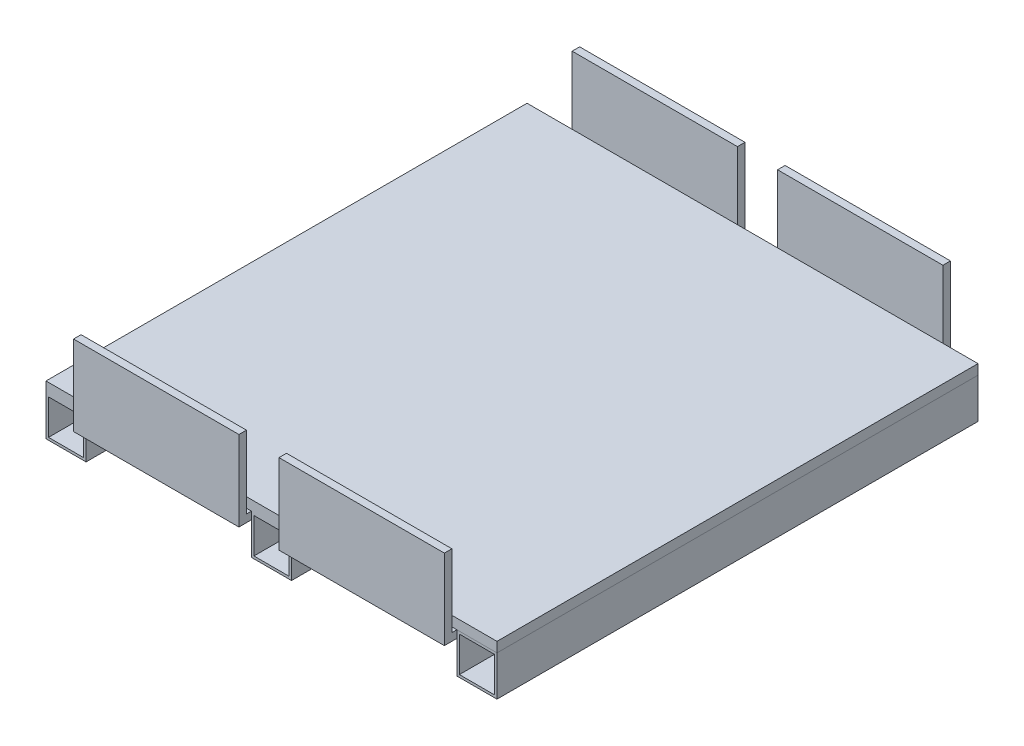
from build123d import *

# Parameters (mm, degrees)
SKETCH1_W                  = 1143
SKETCH1_H                  = 1219.2
BOSS_EXTRUDE1_DEPTH        = 25.4
BOSS_EXTRUDE2_DEPTH        = 609.6
BOSS_EXTRUDE2_DEPTH_BACK   = 609.6
SKETCH3_W                  = 101.6
SKETCH3_H                  = 101.6
SKETCH3_W_2                = 88.9
SKETCH3_H_2                = 88.9
BOSS_EXTRUDE2_2_DEPTH      = 609.6
BOSS_EXTRUDE2_2_DEPTH_BACK = 609.6
BOSS_EXTRUDE2_3_DEPTH      = 609.6
BOSS_EXTRUDE2_3_DEPTH_BACK = 609.6
BOSS_EXTRUDE3_START        = 50.8
BOSS_EXTRUDE3_DEPTH        = 419.1
BOSS_EXTRUDE4_START        = -50.8
BOSS_EXTRUDE4_DEPTH        = 419.1


with BuildPart() as part:
    # Sketch1 → Boss-Extrude1 (new body)
    with BuildSketch(Plane(origin=(0, 0, 0), x_dir=(1, 0, 0), z_dir=(0, 1, 0))):
        Rectangle(SKETCH1_W, SKETCH1_H)
    extrude(amount=BOSS_EXTRUDE1_DEPTH)

    # Sketch7 → Boss-Extrude3 (add)
    with BuildSketch(Plane(origin=(0, 0, 0), x_dir=(0, 0, -1), z_dir=(1, 0, 0)).offset(BOSS_EXTRUDE3_START)):
        Polygon((-488.95, -19.05), (-641.35, -19.05), (-641.35, 184.15), (-622.3, 184.15), (-622.3, 0), (-488.95, 0), align=None)
    extrude(amount=BOSS_EXTRUDE3_DEPTH)



with BuildPart() as body_2:
    # Sketch3 → Boss-Extrude2 (new, two sides: drawn at the far end of the back side and taken through both)
    with BuildSketch(Plane.XY.offset(-BOSS_EXTRUDE2_DEPTH_BACK)):
        with Locations((-520.7, -50.8)):
            Rectangle(SKETCH3_W, SKETCH3_H)
        with Locations((-520.7, -50.8)):
            Rectangle(SKETCH3_W_2, SKETCH3_H_2, mode=Mode.SUBTRACT)
    extrude(amount=BOSS_EXTRUDE2_DEPTH + BOSS_EXTRUDE2_DEPTH_BACK)


with BuildPart() as body_3:
    # Sketch3 → Boss-Extrude2 2 (new, two sides: drawn at the far end of the back side and taken through both)
    with BuildSketch(Plane.XY.offset(-BOSS_EXTRUDE2_2_DEPTH_BACK)):
        with Locations((0, -50.8)):
            Rectangle(SKETCH3_W, SKETCH3_H)
        with Locations((0, -50.8)):
            Rectangle(SKETCH3_W_2, SKETCH3_H_2, mode=Mode.SUBTRACT)
    extrude(amount=BOSS_EXTRUDE2_2_DEPTH + BOSS_EXTRUDE2_2_DEPTH_BACK)


with BuildPart() as body_4:
    # Sketch3 → Boss-Extrude2 3 (new, two sides: drawn at the far end of the back side and taken through both)
    with BuildSketch(Plane.XY.offset(-BOSS_EXTRUDE2_3_DEPTH_BACK)):
        with Locations((520.7, -50.8)):
            Rectangle(SKETCH3_W, SKETCH3_H)
        with Locations((520.7, -50.8)):
            Rectangle(SKETCH3_W_2, SKETCH3_H_2, mode=Mode.SUBTRACT)
    extrude(amount=BOSS_EXTRUDE2_3_DEPTH + BOSS_EXTRUDE2_3_DEPTH_BACK)


with BuildPart() as part_1:
    add(part.part)

    add(body_2.part)  # Boss-Extrude4 merges body 2

    add(body_3.part)  # Boss-Extrude4 merges body 3
    # Sketch7_2 → Boss-Extrude4 (add)
    with BuildSketch(Plane(origin=(0, 0, 0), x_dir=(0, 0, -1), z_dir=(1, 0, 0)).offset(BOSS_EXTRUDE4_START)):
        Polygon((-488.95, -19.05), (-641.35, -19.05), (-641.35, 184.15), (-622.3, 184.15), (-622.3, 0), (-488.95, 0), align=None)
    extrude(amount=-BOSS_EXTRUDE4_DEPTH)

    # Mirror4: part across plane


with BuildPart() as part_2:
    add(part_1.part)
    add(part_1.part.mirror(Plane.XY))


solid = Compound([body_4.part, part_2.part])
